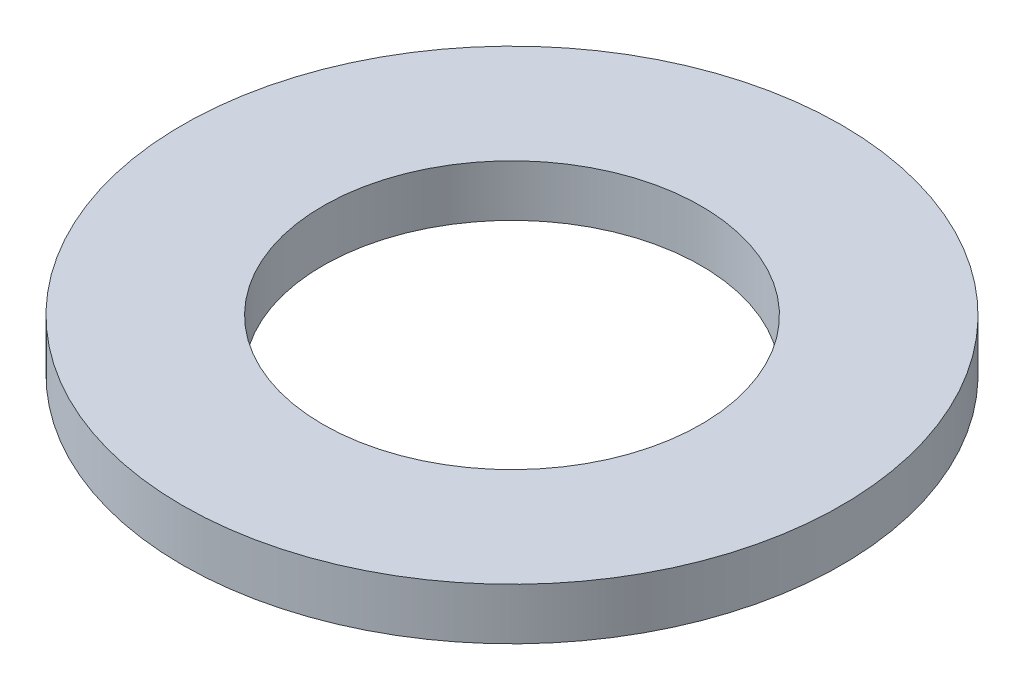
from build123d import *

# Parameters (mm, degrees)
SKETCH1_R      = 57.5
SKETCH1_R_2    = 33
EXTRUDE1_DEPTH = 9


with BuildPart() as part:
    # Sketch1 → Extrude1 (new body)
    with BuildSketch(Plane(origin=(0, 0, 0), x_dir=(1, 0, 0), z_dir=(0, 1, 0))):
        with Locations(Location((0, 0, 0), (0, 0, 270))):
            Circle(SKETCH1_R)
        with Locations(Location((0, 0, 0), (0, 0, 270))):
            Circle(SKETCH1_R_2, mode=Mode.SUBTRACT)
    extrude(amount=EXTRUDE1_DEPTH)


solid = part.part
